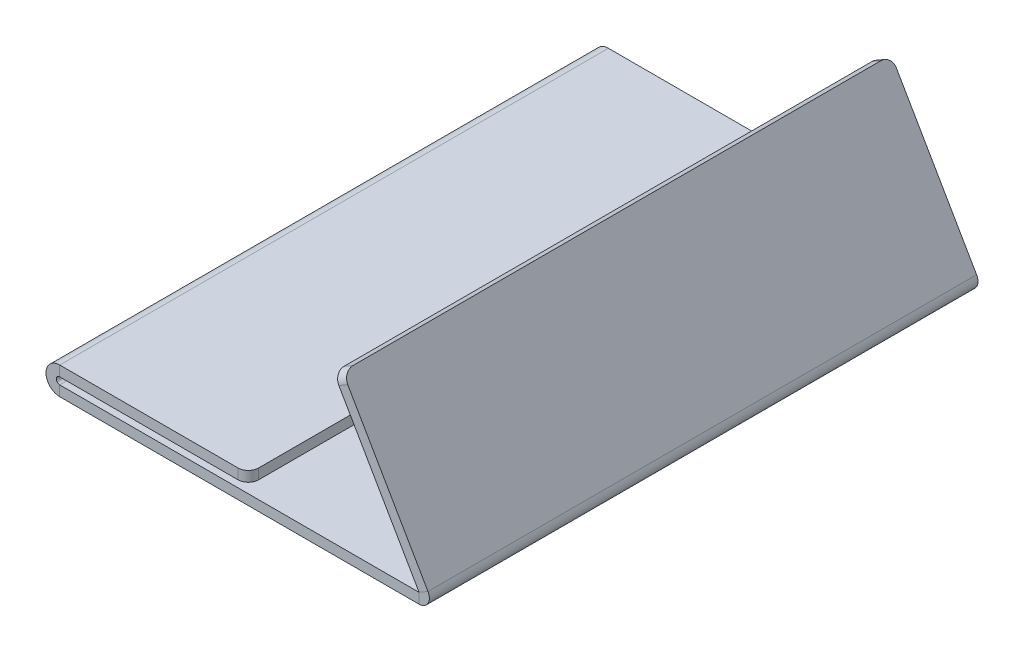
ISO-10303-21;
HEADER;
FILE_DESCRIPTION(('STEP AP214'),'2;1');
FILE_NAME('part.step','',(''),(''),'','','');
FILE_SCHEMA(('AUTOMOTIVE_DESIGN { 1 0 10303 214 1 1 1 1 }'));
ENDSEC;
DATA;
#1=APPLICATION_CONTEXT('core data for automotive mechanical design processes');
#2=APPLICATION_PROTOCOL_DEFINITION('international standard','automotive_design',2000,#1);
#3=PRODUCT_CONTEXT('',#1,'mechanical');
#4=PRODUCT('Part','Part','',(#3));
#5=PRODUCT_RELATED_PRODUCT_CATEGORY('part','',(#4));
#6=PRODUCT_DEFINITION_FORMATION('','',#4);
#7=PRODUCT_DEFINITION_CONTEXT('part definition',#1,'design');
#8=PRODUCT_DEFINITION('design','',#6,#7);
#9=PRODUCT_DEFINITION_SHAPE('','',#8);
#10=(LENGTH_UNIT() NAMED_UNIT(*) SI_UNIT(.MILLI.,.METRE.));
#11=(NAMED_UNIT(*) PLANE_ANGLE_UNIT() SI_UNIT($,.RADIAN.));
#12=(NAMED_UNIT(*) SI_UNIT($,.STERADIAN.) SOLID_ANGLE_UNIT());
#13=UNCERTAINTY_MEASURE_WITH_UNIT(LENGTH_MEASURE(1.E-05),#10,'distance_accuracy_value','');
#14=(GEOMETRIC_REPRESENTATION_CONTEXT(3) GLOBAL_UNCERTAINTY_ASSIGNED_CONTEXT((#13)) GLOBAL_UNIT_ASSIGNED_CONTEXT((#10,
#11,#12)) REPRESENTATION_CONTEXT('',''));
#15=CARTESIAN_POINT('',(0.,0.,0.));
#16=DIRECTION('',(0.,0.,1.));
#17=DIRECTION('',(1.,0.,0.));
#18=AXIS2_PLACEMENT_3D('',#15,#16,#17);
#19=CARTESIAN_POINT('',(0.,0.,-160.));
#20=DIRECTION('',(0.,-1.,0.));
#21=DIRECTION('',(0.,0.,-1.));
#22=AXIS2_PLACEMENT_3D('',#19,#20,#21);
#23=PLANE('',#22);
#24=DIRECTION('',(1.,0.,0.));
#25=VECTOR('',#24,1.);
#26=CARTESIAN_POINT('',(0.,0.,0.));
#27=LINE('',#26,#25);
#28=CARTESIAN_POINT('',(55.005,0.,0.));
#29=VERTEX_POINT('',#28);
#30=CARTESIAN_POINT('',(159.791527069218,0.,0.));
#31=VERTEX_POINT('',#30);
#32=EDGE_CURVE('E224',#29,#31,#27,.T.);
#33=ORIENTED_EDGE('',*,*,#32,.F.);
#34=DIRECTION('',(0.,0.,-1.));
#35=VECTOR('',#34,1.);
#36=CARTESIAN_POINT('',(55.005,0.,-160.));
#37=LINE('',#36,#35);
#38=CARTESIAN_POINT('',(55.005,0.,-160.));
#39=VERTEX_POINT('',#38);
#40=EDGE_CURVE('E263',#29,#39,#37,.T.);
#41=ORIENTED_EDGE('',*,*,#40,.T.);
#42=DIRECTION('',(-1.,0.,0.));
#43=VECTOR('',#42,1.);
#44=CARTESIAN_POINT('',(0.,0.,-160.));
#45=LINE('',#44,#43);
#46=CARTESIAN_POINT('',(159.791527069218,0.,-160.));
#47=VERTEX_POINT('',#46);
#48=EDGE_CURVE('E225',#47,#39,#45,.T.);
#49=ORIENTED_EDGE('',*,*,#48,.F.);
#50=DIRECTION('',(0.,0.,1.));
#51=VECTOR('',#50,1.);
#52=CARTESIAN_POINT('',(159.791527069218,0.,-160.));
#53=LINE('',#52,#51);
#54=EDGE_CURVE('E221',#47,#31,#53,.T.);
#55=ORIENTED_EDGE('',*,*,#54,.T.);
#56=EDGE_LOOP('',(#33,#41,#49,#55));
#57=FACE_BOUND('',#56,.T.);
#58=ADVANCED_FACE('F40',(#57),#23,.T.);
#59=CARTESIAN_POINT('',(244.904423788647,-144.389861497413,-160.));
#60=DIRECTION('',(0.866025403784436,0.500000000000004,0.));
#61=DIRECTION('',(0.,0.,-1.));
#62=AXIS2_PLACEMENT_3D('',#59,#60,#61);
#63=PLANE('',#62);
#64=DIRECTION('',(-0.500000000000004,0.866025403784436,0.));
#65=VECTOR('',#64,1.);
#66=CARTESIAN_POINT('',(244.904423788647,-144.389861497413,0.));
#67=LINE('',#66,#65);
#68=CARTESIAN_POINT('',(159.800187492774,3.01500009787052,0.));
#69=VERTEX_POINT('',#68);
#70=CARTESIAN_POINT('',(136.404423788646,43.5376511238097,0.));
#71=VERTEX_POINT('',#70);
#72=EDGE_CURVE('E243',#69,#71,#67,.T.);
#73=ORIENTED_EDGE('',*,*,#72,.T.);
#74=CARTESIAN_POINT('',(136.404423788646,43.5376511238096,-3.));
#75=DIRECTION('',(0.866025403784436,0.500000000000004,0.));
#76=DIRECTION('',(-0.500000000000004,0.866025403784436,0.));
#77=AXIS2_PLACEMENT_3D('',#74,#75,#76);
#78=CIRCLE('',#77,3.);
#79=CARTESIAN_POINT('',(134.904423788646,46.1357273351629,-3.));
#80=VERTEX_POINT('',#79);
#81=EDGE_CURVE('E48',#71,#80,#78,.F.);
#82=ORIENTED_EDGE('',*,*,#81,.T.);
#83=DIRECTION('',(0.,0.,-1.));
#84=VECTOR('',#83,1.);
#85=CARTESIAN_POINT('',(134.904423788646,46.1357273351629,0.));
#86=LINE('',#85,#84);
#87=CARTESIAN_POINT('',(134.904423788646,46.1357273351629,-157.));
#88=VERTEX_POINT('',#87);
#89=EDGE_CURVE('E240',#80,#88,#86,.T.);
#90=ORIENTED_EDGE('',*,*,#89,.T.);
#91=CARTESIAN_POINT('',(136.404423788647,43.5376511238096,-157.));
#92=DIRECTION('',(0.866025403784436,0.500000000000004,0.));
#93=DIRECTION('',(-0.500000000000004,0.866025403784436,0.));
#94=AXIS2_PLACEMENT_3D('',#91,#92,#93);
#95=CIRCLE('',#94,3.);
#96=CARTESIAN_POINT('',(136.404423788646,43.5376511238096,-160.));
#97=VERTEX_POINT('',#96);
#98=EDGE_CURVE('E55',#88,#97,#95,.F.);
#99=ORIENTED_EDGE('',*,*,#98,.T.);
#100=DIRECTION('',(0.500000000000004,-0.866025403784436,0.));
#101=VECTOR('',#100,1.);
#102=CARTESIAN_POINT('',(244.904423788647,-144.389861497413,-160.));
#103=LINE('',#102,#101);
#104=CARTESIAN_POINT('',(159.800187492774,3.01500009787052,-160.));
#105=VERTEX_POINT('',#104);
#106=EDGE_CURVE('E242',#97,#105,#103,.T.);
#107=ORIENTED_EDGE('',*,*,#106,.T.);
#108=DIRECTION('',(0.,0.,1.));
#109=VECTOR('',#108,1.);
#110=CARTESIAN_POINT('',(159.800187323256,3.01499999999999,-160.));
#111=LINE('',#110,#109);
#112=EDGE_CURVE('E244',#105,#69,#111,.T.);
#113=ORIENTED_EDGE('',*,*,#112,.T.);
#114=EDGE_LOOP('',(#73,#82,#90,#99,#107,#113));
#115=FACE_BOUND('',#114,.T.);
#116=ADVANCED_FACE('F303',(#115),#63,.F.);
#117=CARTESIAN_POINT('',(244.904423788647,-144.389861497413,-160.));
#118=DIRECTION('',(0.,0.,1.));
#119=DIRECTION('',(-0.500000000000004,0.866025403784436,0.));
#120=AXIS2_PLACEMENT_3D('',#117,#118,#119);
#121=PLANE('',#120);
#122=ORIENTED_EDGE('',*,*,#106,.F.);
#123=DIRECTION('',(0.866025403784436,0.500000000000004,0.));
#124=VECTOR('',#123,1.);
#125=CARTESIAN_POINT('',(136.404423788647,43.5376511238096,-160.));
#126=LINE('',#125,#124);
#127=CARTESIAN_POINT('',(139.0025,45.0376511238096,-160.));
#128=VERTEX_POINT('',#127);
#129=EDGE_CURVE('E12',#97,#128,#126,.T.);
#130=ORIENTED_EDGE('',*,*,#129,.T.);
#131=DIRECTION('',(0.500000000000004,-0.866025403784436,0.));
#132=VECTOR('',#131,1.);
#133=CARTESIAN_POINT('',(247.502500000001,-142.889861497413,-160.));
#134=LINE('',#133,#132);
#135=CARTESIAN_POINT('',(162.398263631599,4.51500005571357,-160.));
#136=VERTEX_POINT('',#135);
#137=EDGE_CURVE('E238',#128,#136,#134,.T.);
#138=ORIENTED_EDGE('',*,*,#137,.T.);
#139=DIRECTION('',(-0.866025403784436,-0.500000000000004,0.));
#140=VECTOR('',#139,1.);
#141=CARTESIAN_POINT('',(159.800187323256,3.01499999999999,-160.));
#142=LINE('',#141,#140);
#143=EDGE_CURVE('E247',#136,#105,#142,.T.);
#144=ORIENTED_EDGE('',*,*,#143,.T.);
#145=EDGE_LOOP('',(#122,#130,#138,#144));
#146=FACE_BOUND('',#145,.T.);
#147=ADVANCED_FACE('F384',(#146),#121,.F.);
#148=CARTESIAN_POINT('',(244.904423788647,-144.389861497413,0.));
#149=DIRECTION('',(0.,0.,-1.));
#150=DIRECTION('',(0.500000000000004,-0.866025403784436,0.));
#151=AXIS2_PLACEMENT_3D('',#148,#149,#150);
#152=PLANE('',#151);
#153=DIRECTION('',(-0.500000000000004,0.866025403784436,0.));
#154=VECTOR('',#153,1.);
#155=CARTESIAN_POINT('',(247.502500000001,-142.889861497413,0.));
#156=LINE('',#155,#154);
#157=CARTESIAN_POINT('',(162.398263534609,4.51499999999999,0.));
#158=VERTEX_POINT('',#157);
#159=CARTESIAN_POINT('',(139.0025,45.0376511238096,0.));
#160=VERTEX_POINT('',#159);
#161=EDGE_CURVE('E239',#158,#160,#156,.T.);
#162=ORIENTED_EDGE('',*,*,#161,.T.);
#163=DIRECTION('',(0.866025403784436,0.500000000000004,0.));
#164=VECTOR('',#163,1.);
#165=CARTESIAN_POINT('',(136.404423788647,43.5376511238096,0.));
#166=LINE('',#165,#164);
#167=EDGE_CURVE('E63',#160,#71,#166,.F.);
#168=ORIENTED_EDGE('',*,*,#167,.T.);
#169=ORIENTED_EDGE('',*,*,#72,.F.);
#170=DIRECTION('',(0.866025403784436,0.500000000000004,0.));
#171=VECTOR('',#170,1.);
#172=CARTESIAN_POINT('',(159.800187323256,3.01499999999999,0.));
#173=LINE('',#172,#171);
#174=EDGE_CURVE('E252',#69,#158,#173,.T.);
#175=ORIENTED_EDGE('',*,*,#174,.T.);
#176=EDGE_LOOP('',(#162,#168,#169,#175));
#177=FACE_BOUND('',#176,.T.);
#178=ADVANCED_FACE('F315',(#177),#152,.F.);
#179=CARTESIAN_POINT('',(134.904423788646,46.1357273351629,0.));
#180=DIRECTION('',(0.500000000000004,-0.866025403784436,0.));
#181=DIRECTION('',(0.,0.,1.));
#182=AXIS2_PLACEMENT_3D('',#179,#180,#181);
#183=PLANE('',#182);
#184=ORIENTED_EDGE('',*,*,#89,.F.);
#185=DIRECTION('',(0.866025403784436,0.500000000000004,0.));
#186=VECTOR('',#185,1.);
#187=CARTESIAN_POINT('',(134.904423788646,46.1357273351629,-3.));
#188=LINE('',#187,#186);
#189=CARTESIAN_POINT('',(137.5025,47.6357273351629,-3.));
#190=VERTEX_POINT('',#189);
#191=EDGE_CURVE('E293',#80,#190,#188,.T.);
#192=ORIENTED_EDGE('',*,*,#191,.T.);
#193=DIRECTION('',(0.,0.,-1.));
#194=VECTOR('',#193,1.);
#195=CARTESIAN_POINT('',(137.5025,47.6357273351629,0.));
#196=LINE('',#195,#194);
#197=CARTESIAN_POINT('',(137.5025,47.6357273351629,-157.));
#198=VERTEX_POINT('',#197);
#199=EDGE_CURVE('E235',#190,#198,#196,.T.);
#200=ORIENTED_EDGE('',*,*,#199,.T.);
#201=DIRECTION('',(0.866025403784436,0.500000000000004,0.));
#202=VECTOR('',#201,1.);
#203=CARTESIAN_POINT('',(134.904423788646,46.1357273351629,-157.));
#204=LINE('',#203,#202);
#205=EDGE_CURVE('E291',#198,#88,#204,.F.);
#206=ORIENTED_EDGE('',*,*,#205,.T.);
#207=EDGE_LOOP('',(#184,#192,#200,#206));
#208=FACE_BOUND('',#207,.T.);
#209=ADVANCED_FACE('F307',(#208),#183,.F.);
#210=CARTESIAN_POINT('',(247.502500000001,-142.889861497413,-160.));
#211=DIRECTION('',(0.866025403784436,0.500000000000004,0.));
#212=DIRECTION('',(0.,0.,-1.));
#213=AXIS2_PLACEMENT_3D('',#210,#211,#212);
#214=PLANE('',#213);
#215=ORIENTED_EDGE('',*,*,#199,.F.);
#216=CARTESIAN_POINT('',(139.0025,45.0376511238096,-3.));
#217=DIRECTION('',(0.866025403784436,0.500000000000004,0.));
#218=DIRECTION('',(-0.500000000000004,0.866025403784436,0.));
#219=AXIS2_PLACEMENT_3D('',#216,#217,#218);
#220=CIRCLE('',#219,3.);
#221=EDGE_CURVE('E298',#190,#160,#220,.T.);
#222=ORIENTED_EDGE('',*,*,#221,.T.);
#223=ORIENTED_EDGE('',*,*,#161,.F.);
#224=DIRECTION('',(0.,0.,1.));
#225=VECTOR('',#224,1.);
#226=CARTESIAN_POINT('',(162.398263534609,4.51499999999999,-160.));
#227=LINE('',#226,#225);
#228=EDGE_CURVE('E250',#136,#158,#227,.T.);
#229=ORIENTED_EDGE('',*,*,#228,.F.);
#230=ORIENTED_EDGE('',*,*,#137,.F.);
#231=CARTESIAN_POINT('',(139.0025,45.0376511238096,-157.));
#232=DIRECTION('',(0.866025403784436,0.500000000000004,0.));
#233=DIRECTION('',(-0.500000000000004,0.866025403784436,0.));
#234=AXIS2_PLACEMENT_3D('',#231,#232,#233);
#235=CIRCLE('',#234,3.);
#236=EDGE_CURVE('E296',#128,#198,#235,.T.);
#237=ORIENTED_EDGE('',*,*,#236,.T.);
#238=EDGE_LOOP('',(#215,#222,#223,#229,#230,#237));
#239=FACE_BOUND('',#238,.T.);
#240=ADVANCED_FACE('F313',(#239),#214,.T.);
#241=CARTESIAN_POINT('',(0.,3.,-160.));
#242=DIRECTION('',(0.,-1.,0.));
#243=DIRECTION('',(0.,0.,-1.));
#244=AXIS2_PLACEMENT_3D('',#241,#242,#243);
#245=PLANE('',#244);
#246=DIRECTION('',(0.,0.,-1.));
#247=VECTOR('',#246,1.);
#248=CARTESIAN_POINT('',(55.005,3.,-160.));
#249=LINE('',#248,#247);
#250=CARTESIAN_POINT('',(55.005,3.,0.));
#251=VERTEX_POINT('',#250);
#252=CARTESIAN_POINT('',(55.005,3.,-160.));
#253=VERTEX_POINT('',#252);
#254=EDGE_CURVE('E255',#251,#253,#249,.T.);
#255=ORIENTED_EDGE('',*,*,#254,.F.);
#256=DIRECTION('',(1.,0.,0.));
#257=VECTOR('',#256,1.);
#258=CARTESIAN_POINT('',(0.,3.,0.));
#259=LINE('',#258,#257);
#260=CARTESIAN_POINT('',(159.791527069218,3.,0.));
#261=VERTEX_POINT('',#260);
#262=EDGE_CURVE('E272',#251,#261,#259,.T.);
#263=ORIENTED_EDGE('',*,*,#262,.T.);
#264=DIRECTION('',(0.,0.,1.));
#265=VECTOR('',#264,1.);
#266=CARTESIAN_POINT('',(159.791527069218,3.,-160.));
#267=LINE('',#266,#265);
#268=CARTESIAN_POINT('',(159.791527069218,2.99999997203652,-160.));
#269=VERTEX_POINT('',#268);
#270=EDGE_CURVE('E220',#269,#261,#267,.T.);
#271=ORIENTED_EDGE('',*,*,#270,.F.);
#272=DIRECTION('',(-1.,0.,0.));
#273=VECTOR('',#272,1.);
#274=CARTESIAN_POINT('',(0.,3.,-160.));
#275=LINE('',#274,#273);
#276=EDGE_CURVE('E229',#269,#253,#275,.T.);
#277=ORIENTED_EDGE('',*,*,#276,.T.);
#278=EDGE_LOOP('',(#255,#263,#271,#277));
#279=FACE_BOUND('',#278,.T.);
#280=ADVANCED_FACE('F389',(#279),#245,.F.);
#281=CARTESIAN_POINT('',(0.,3.,-160.));
#282=DIRECTION('',(0.,0.,1.));
#283=DIRECTION('',(1.,0.,0.));
#284=AXIS2_PLACEMENT_3D('',#281,#282,#283);
#285=PLANE('',#284);
#286=DIRECTION('',(0.,-1.,0.));
#287=VECTOR('',#286,1.);
#288=CARTESIAN_POINT('',(55.005,3.,-160.));
#289=LINE('',#288,#287);
#290=EDGE_CURVE('E186',#253,#39,#289,.T.);
#291=ORIENTED_EDGE('',*,*,#290,.F.);
#292=ORIENTED_EDGE('',*,*,#276,.F.);
#293=DIRECTION('',(0.,1.,0.));
#294=VECTOR('',#293,1.);
#295=CARTESIAN_POINT('',(159.791527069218,3.,-160.));
#296=LINE('',#295,#294);
#297=EDGE_CURVE('E226',#47,#269,#296,.T.);
#298=ORIENTED_EDGE('',*,*,#297,.F.);
#299=ORIENTED_EDGE('',*,*,#48,.T.);
#300=EDGE_LOOP('',(#291,#292,#298,#299));
#301=FACE_BOUND('',#300,.T.);
#302=ADVANCED_FACE('F334',(#301),#285,.F.);
#303=CARTESIAN_POINT('',(0.,3.,0.));
#304=DIRECTION('',(0.,0.,-1.));
#305=DIRECTION('',(-1.,0.,0.));
#306=AXIS2_PLACEMENT_3D('',#303,#304,#305);
#307=PLANE('',#306);
#308=DIRECTION('',(0.,1.,0.));
#309=VECTOR('',#308,1.);
#310=CARTESIAN_POINT('',(55.005,3.,0.));
#311=LINE('',#310,#309);
#312=EDGE_CURVE('E266',#29,#251,#311,.T.);
#313=ORIENTED_EDGE('',*,*,#312,.F.);
#314=ORIENTED_EDGE('',*,*,#32,.T.);
#315=DIRECTION('',(0.,-1.,0.));
#316=VECTOR('',#315,1.);
#317=CARTESIAN_POINT('',(159.791527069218,3.,0.));
#318=LINE('',#317,#316);
#319=EDGE_CURVE('E230',#261,#31,#318,.T.);
#320=ORIENTED_EDGE('',*,*,#319,.F.);
#321=ORIENTED_EDGE('',*,*,#262,.F.);
#322=EDGE_LOOP('',(#313,#314,#320,#321));
#323=FACE_BOUND('',#322,.T.);
#324=ADVANCED_FACE('F42',(#323),#307,.F.);
#325=CARTESIAN_POINT('',(159.791527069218,3.01000011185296,-160.));
#326=DIRECTION('',(0.,0.,1.));
#327=DIRECTION('',(1.,0.,0.));
#328=AXIS2_PLACEMENT_3D('',#325,#326,#327);
#329=PLANE('',#328);
#330=ORIENTED_EDGE('',*,*,#143,.F.);
#331=CARTESIAN_POINT('',(159.791527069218,3.01,-160.));
#332=DIRECTION('',(0.,0.,-1.));
#333=DIRECTION('',(-1.,0.,0.));
#334=AXIS2_PLACEMENT_3D('',#331,#332,#333);
#335=CIRCLE('',#334,3.01000011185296);
#336=EDGE_CURVE('E208',#136,#47,#335,.T.);
#337=ORIENTED_EDGE('',*,*,#336,.T.);
#338=ORIENTED_EDGE('',*,*,#297,.T.);
#339=CARTESIAN_POINT('',(159.791527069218,3.01000011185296,-160.));
#340=DIRECTION('',(0.,0.,-1.));
#341=DIRECTION('',(-1.,0.,0.));
#342=AXIS2_PLACEMENT_3D('',#339,#340,#341);
#343=CIRCLE('',#342,0.0100001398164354);
#344=EDGE_CURVE('E212',#105,#269,#343,.T.);
#345=ORIENTED_EDGE('',*,*,#344,.F.);
#346=EDGE_LOOP('',(#330,#337,#338,#345));
#347=FACE_BOUND('',#346,.T.);
#348=ADVANCED_FACE('F329',(#347),#329,.F.);
#349=CARTESIAN_POINT('',(159.791527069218,3.01000011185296,0.));
#350=DIRECTION('',(0.,0.,-1.));
#351=DIRECTION('',(-1.,0.,0.));
#352=AXIS2_PLACEMENT_3D('',#349,#350,#351);
#353=PLANE('',#352);
#354=ORIENTED_EDGE('',*,*,#319,.T.);
#355=CARTESIAN_POINT('',(159.791527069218,3.01,0.));
#356=DIRECTION('',(0.,0.,-1.));
#357=DIRECTION('',(-1.,0.,0.));
#358=AXIS2_PLACEMENT_3D('',#355,#356,#357);
#359=CIRCLE('',#358,3.01000011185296);
#360=EDGE_CURVE('E209',#31,#158,#359,.F.);
#361=ORIENTED_EDGE('',*,*,#360,.T.);
#362=ORIENTED_EDGE('',*,*,#174,.F.);
#363=CARTESIAN_POINT('',(159.791527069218,3.01000011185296,0.));
#364=DIRECTION('',(0.,0.,1.));
#365=DIRECTION('',(1.,0.,0.));
#366=AXIS2_PLACEMENT_3D('',#363,#364,#365);
#367=CIRCLE('',#366,0.0100001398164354);
#368=EDGE_CURVE('E217',#261,#69,#367,.T.);
#369=ORIENTED_EDGE('',*,*,#368,.F.);
#370=EDGE_LOOP('',(#354,#361,#362,#369));
#371=FACE_BOUND('',#370,.T.);
#372=ADVANCED_FACE('F318',(#371),#353,.F.);
#373=CARTESIAN_POINT('',(159.791527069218,3.01,80.3668069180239));
#374=DIRECTION('',(0.,0.,-1.));
#375=DIRECTION('',(-1.,0.,0.));
#376=AXIS2_PLACEMENT_3D('',#373,#374,#375);
#377=CYLINDRICAL_SURFACE('',#376,0.0100001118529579);
#378=ORIENTED_EDGE('',*,*,#368,.T.);
#379=ORIENTED_EDGE('',*,*,#112,.F.);
#380=ORIENTED_EDGE('',*,*,#344,.T.);
#381=ORIENTED_EDGE('',*,*,#270,.T.);
#382=EDGE_LOOP('',(#378,#379,#380,#381));
#383=FACE_BOUND('',#382,.T.);
#384=ADVANCED_FACE('F322',(#383),#377,.F.);
#385=CARTESIAN_POINT('',(159.791527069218,3.01,80.3668069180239));
#386=DIRECTION('',(0.,0.,-1.));
#387=DIRECTION('',(-1.,0.,0.));
#388=AXIS2_PLACEMENT_3D('',#385,#386,#387);
#389=CYLINDRICAL_SURFACE('',#388,3.01000011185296);
#390=ORIENTED_EDGE('',*,*,#360,.F.);
#391=ORIENTED_EDGE('',*,*,#54,.F.);
#392=ORIENTED_EDGE('',*,*,#336,.F.);
#393=ORIENTED_EDGE('',*,*,#228,.T.);
#394=EDGE_LOOP('',(#390,#391,#392,#393));
#395=FACE_BOUND('',#394,.T.);
#396=ADVANCED_FACE('F336',(#395),#389,.T.);
#397=CARTESIAN_POINT('',(55.005,4.00999996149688,0.));
#398=DIRECTION('',(0.,0.,-1.));
#399=DIRECTION('',(-1.,0.,0.));
#400=AXIS2_PLACEMENT_3D('',#397,#398,#399);
#401=PLANE('',#400);
#402=DIRECTION('',(0.,-1.,0.));
#403=VECTOR('',#402,1.);
#404=CARTESIAN_POINT('',(55.005,5.02,0.));
#405=LINE('',#404,#403);
#406=CARTESIAN_POINT('',(55.0050000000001,8.02,0.));
#407=VERTEX_POINT('',#406);
#408=CARTESIAN_POINT('',(55.005,5.02,0.));
#409=VERTEX_POINT('',#408);
#410=EDGE_CURVE('E203',#407,#409,#405,.T.);
#411=ORIENTED_EDGE('',*,*,#410,.F.);
#412=CARTESIAN_POINT('',(55.005,4.01,0.));
#413=DIRECTION('',(0.,0.,1.));
#414=DIRECTION('',(1.,0.,0.));
#415=AXIS2_PLACEMENT_3D('',#412,#413,#414);
#416=CIRCLE('',#415,4.00999996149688);
#417=EDGE_CURVE('E190',#407,#29,#416,.T.);
#418=ORIENTED_EDGE('',*,*,#417,.T.);
#419=ORIENTED_EDGE('',*,*,#312,.T.);
#420=CARTESIAN_POINT('',(55.005,4.00999996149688,0.));
#421=DIRECTION('',(0.,0.,1.));
#422=DIRECTION('',(1.,0.,0.));
#423=AXIS2_PLACEMENT_3D('',#420,#421,#422);
#424=CIRCLE('',#423,1.00999996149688);
#425=EDGE_CURVE('E189',#409,#251,#424,.T.);
#426=ORIENTED_EDGE('',*,*,#425,.F.);
#427=EDGE_LOOP('',(#411,#418,#419,#426));
#428=FACE_BOUND('',#427,.T.);
#429=ADVANCED_FACE('F344',(#428),#401,.F.);
#430=CARTESIAN_POINT('',(55.005,4.00999996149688,-160.));
#431=DIRECTION('',(0.,0.,1.));
#432=DIRECTION('',(1.,0.,0.));
#433=AXIS2_PLACEMENT_3D('',#430,#431,#432);
#434=PLANE('',#433);
#435=ORIENTED_EDGE('',*,*,#290,.T.);
#436=CARTESIAN_POINT('',(55.005,4.01,-160.));
#437=DIRECTION('',(0.,0.,1.));
#438=DIRECTION('',(1.,0.,0.));
#439=AXIS2_PLACEMENT_3D('',#436,#437,#438);
#440=CIRCLE('',#439,4.00999996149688);
#441=CARTESIAN_POINT('',(55.0050000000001,8.02,-160.));
#442=VERTEX_POINT('',#441);
#443=EDGE_CURVE('E183',#39,#442,#440,.F.);
#444=ORIENTED_EDGE('',*,*,#443,.T.);
#445=DIRECTION('',(0.,1.,0.));
#446=VECTOR('',#445,1.);
#447=CARTESIAN_POINT('',(55.005,5.02,-160.));
#448=LINE('',#447,#446);
#449=CARTESIAN_POINT('',(55.0049999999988,5.01999992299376,-160.));
#450=VERTEX_POINT('',#449);
#451=EDGE_CURVE('E168',#450,#442,#448,.T.);
#452=ORIENTED_EDGE('',*,*,#451,.F.);
#453=CARTESIAN_POINT('',(55.005,4.00999996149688,-160.));
#454=DIRECTION('',(0.,0.,-1.));
#455=DIRECTION('',(-1.,0.,0.));
#456=AXIS2_PLACEMENT_3D('',#453,#454,#455);
#457=CIRCLE('',#456,1.00999996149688);
#458=EDGE_CURVE('E206',#253,#450,#457,.T.);
#459=ORIENTED_EDGE('',*,*,#458,.F.);
#460=EDGE_LOOP('',(#435,#444,#452,#459));
#461=FACE_BOUND('',#460,.T.);
#462=ADVANCED_FACE('F184',(#461),#434,.F.);
#463=CARTESIAN_POINT('',(55.005,4.01,-240.028122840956));
#464=DIRECTION('',(0.,0.,1.));
#465=DIRECTION('',(1.,0.,0.));
#466=AXIS2_PLACEMENT_3D('',#463,#464,#465);
#467=CYLINDRICAL_SURFACE('',#466,1.00999996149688);
#468=ORIENTED_EDGE('',*,*,#458,.T.);
#469=DIRECTION('',(0.,0.,-1.));
#470=VECTOR('',#469,1.);
#471=CARTESIAN_POINT('',(55.005,5.02,-160.));
#472=LINE('',#471,#470);
#473=EDGE_CURVE('E355',#409,#450,#472,.T.);
#474=ORIENTED_EDGE('',*,*,#473,.F.);
#475=ORIENTED_EDGE('',*,*,#425,.T.);
#476=ORIENTED_EDGE('',*,*,#254,.T.);
#477=EDGE_LOOP('',(#468,#474,#475,#476));
#478=FACE_BOUND('',#477,.T.);
#479=ADVANCED_FACE('F413',(#478),#467,.F.);
#480=CARTESIAN_POINT('',(55.005,4.01,-240.028122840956));
#481=DIRECTION('',(0.,0.,1.));
#482=DIRECTION('',(1.,0.,0.));
#483=AXIS2_PLACEMENT_3D('',#480,#481,#482);
#484=CYLINDRICAL_SURFACE('',#483,4.00999996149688);
#485=ORIENTED_EDGE('',*,*,#443,.F.);
#486=ORIENTED_EDGE('',*,*,#40,.F.);
#487=ORIENTED_EDGE('',*,*,#417,.F.);
#488=DIRECTION('',(0.,0.,-1.));
#489=VECTOR('',#488,1.);
#490=CARTESIAN_POINT('',(55.0050000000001,8.02,-160.));
#491=LINE('',#490,#489);
#492=EDGE_CURVE('E162',#407,#442,#491,.T.);
#493=ORIENTED_EDGE('',*,*,#492,.T.);
#494=EDGE_LOOP('',(#485,#486,#487,#493));
#495=FACE_BOUND('',#494,.T.);
#496=ADVANCED_FACE('F193',(#495),#484,.T.);
#497=CARTESIAN_POINT('',(110.,5.01999999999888,0.));
#498=DIRECTION('',(-1.,0.,0.));
#499=DIRECTION('',(0.,0.,-1.));
#500=AXIS2_PLACEMENT_3D('',#497,#498,#499);
#501=PLANE('',#500);
#502=DIRECTION('',(0.,0.,1.));
#503=VECTOR('',#502,1.);
#504=CARTESIAN_POINT('',(110.,5.01999999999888,0.));
#505=LINE('',#504,#503);
#506=CARTESIAN_POINT('',(110.,5.01999999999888,-157.));
#507=VERTEX_POINT('',#506);
#508=CARTESIAN_POINT('',(110.,5.01999999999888,-3.));
#509=VERTEX_POINT('',#508);
#510=EDGE_CURVE('E179',#507,#509,#505,.T.);
#511=ORIENTED_EDGE('',*,*,#510,.F.);
#512=DIRECTION('',(0.,1.,0.));
#513=VECTOR('',#512,1.);
#514=CARTESIAN_POINT('',(110.,5.01999999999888,-157.));
#515=LINE('',#514,#513);
#516=CARTESIAN_POINT('',(110.,8.01999999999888,-157.));
#517=VERTEX_POINT('',#516);
#518=EDGE_CURVE('E276',#507,#517,#515,.T.);
#519=ORIENTED_EDGE('',*,*,#518,.T.);
#520=DIRECTION('',(0.,0.,1.));
#521=VECTOR('',#520,1.);
#522=CARTESIAN_POINT('',(110.,8.01999999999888,0.));
#523=LINE('',#522,#521);
#524=CARTESIAN_POINT('',(110.,8.01999999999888,-3.));
#525=VERTEX_POINT('',#524);
#526=EDGE_CURVE('E195',#517,#525,#523,.T.);
#527=ORIENTED_EDGE('',*,*,#526,.T.);
#528=DIRECTION('',(0.,1.,0.));
#529=VECTOR('',#528,1.);
#530=CARTESIAN_POINT('',(110.,5.01999999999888,-3.));
#531=LINE('',#530,#529);
#532=EDGE_CURVE('E269',#525,#509,#531,.F.);
#533=ORIENTED_EDGE('',*,*,#532,.T.);
#534=EDGE_LOOP('',(#511,#519,#527,#533));
#535=FACE_BOUND('',#534,.T.);
#536=ADVANCED_FACE('F366',(#535),#501,.F.);
#537=CARTESIAN_POINT('',(110.,5.01999999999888,-160.));
#538=DIRECTION('',(0.,1.,0.));
#539=DIRECTION('',(0.,0.,-1.));
#540=AXIS2_PLACEMENT_3D('',#537,#538,#539);
#541=PLANE('',#540);
#542=DIRECTION('',(1.,0.,0.));
#543=VECTOR('',#542,1.);
#544=CARTESIAN_POINT('',(110.,5.01999999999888,-160.));
#545=LINE('',#544,#543);
#546=CARTESIAN_POINT('',(107.,5.01999999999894,-160.));
#547=VERTEX_POINT('',#546);
#548=EDGE_CURVE('E174',#450,#547,#545,.T.);
#549=ORIENTED_EDGE('',*,*,#548,.T.);
#550=CARTESIAN_POINT('',(107.,5.01999999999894,-157.));
#551=DIRECTION('',(0.,1.,0.));
#552=DIRECTION('',(-1.,0.,0.));
#553=AXIS2_PLACEMENT_3D('',#550,#551,#552);
#554=CIRCLE('',#553,3.);
#555=EDGE_CURVE('E286',#547,#507,#554,.F.);
#556=ORIENTED_EDGE('',*,*,#555,.T.);
#557=ORIENTED_EDGE('',*,*,#510,.T.);
#558=CARTESIAN_POINT('',(107.,5.01999999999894,-3.));
#559=DIRECTION('',(0.,1.,0.));
#560=DIRECTION('',(-1.,0.,0.));
#561=AXIS2_PLACEMENT_3D('',#558,#559,#560);
#562=CIRCLE('',#561,3.);
#563=CARTESIAN_POINT('',(107.,5.01999999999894,0.));
#564=VERTEX_POINT('',#563);
#565=EDGE_CURVE('E284',#509,#564,#562,.F.);
#566=ORIENTED_EDGE('',*,*,#565,.T.);
#567=DIRECTION('',(-1.,0.,0.));
#568=VECTOR('',#567,1.);
#569=CARTESIAN_POINT('',(110.,5.01999999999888,0.));
#570=LINE('',#569,#568);
#571=EDGE_CURVE('E198',#564,#409,#570,.T.);
#572=ORIENTED_EDGE('',*,*,#571,.T.);
#573=ORIENTED_EDGE('',*,*,#473,.T.);
#574=EDGE_LOOP('',(#549,#556,#557,#566,#572,#573));
#575=FACE_BOUND('',#574,.T.);
#576=ADVANCED_FACE('F357',(#575),#541,.F.);
#577=CARTESIAN_POINT('',(110.,5.01999999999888,-160.));
#578=DIRECTION('',(0.,0.,1.));
#579=DIRECTION('',(-1.,0.,0.));
#580=AXIS2_PLACEMENT_3D('',#577,#578,#579);
#581=PLANE('',#580);
#582=DIRECTION('',(1.,0.,0.));
#583=VECTOR('',#582,1.);
#584=CARTESIAN_POINT('',(110.,8.01999999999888,-160.));
#585=LINE('',#584,#583);
#586=CARTESIAN_POINT('',(107.,8.01999999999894,-160.));
#587=VERTEX_POINT('',#586);
#588=EDGE_CURVE('E156',#442,#587,#585,.T.);
#589=ORIENTED_EDGE('',*,*,#588,.T.);
#590=DIRECTION('',(0.,1.,0.));
#591=VECTOR('',#590,1.);
#592=CARTESIAN_POINT('',(107.,5.01999999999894,-160.));
#593=LINE('',#592,#591);
#594=EDGE_CURVE('E282',#587,#547,#593,.F.);
#595=ORIENTED_EDGE('',*,*,#594,.T.);
#596=ORIENTED_EDGE('',*,*,#548,.F.);
#597=ORIENTED_EDGE('',*,*,#451,.T.);
#598=EDGE_LOOP('',(#589,#595,#596,#597));
#599=FACE_BOUND('',#598,.T.);
#600=ADVANCED_FACE('F172',(#599),#581,.F.);
#601=CARTESIAN_POINT('',(110.,8.01999999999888,-160.));
#602=DIRECTION('',(0.,1.,0.));
#603=DIRECTION('',(0.,0.,-1.));
#604=AXIS2_PLACEMENT_3D('',#601,#602,#603);
#605=PLANE('',#604);
#606=ORIENTED_EDGE('',*,*,#526,.F.);
#607=CARTESIAN_POINT('',(107.,8.01999999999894,-157.));
#608=DIRECTION('',(0.,1.,0.));
#609=DIRECTION('',(-1.,0.,0.));
#610=AXIS2_PLACEMENT_3D('',#607,#608,#609);
#611=CIRCLE('',#610,3.);
#612=EDGE_CURVE('E164',#517,#587,#611,.T.);
#613=ORIENTED_EDGE('',*,*,#612,.T.);
#614=ORIENTED_EDGE('',*,*,#588,.F.);
#615=ORIENTED_EDGE('',*,*,#492,.F.);
#616=DIRECTION('',(-1.,0.,0.));
#617=VECTOR('',#616,1.);
#618=CARTESIAN_POINT('',(110.,8.01999999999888,0.));
#619=LINE('',#618,#617);
#620=CARTESIAN_POINT('',(107.,8.01999999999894,0.));
#621=VERTEX_POINT('',#620);
#622=EDGE_CURVE('E167',#621,#407,#619,.T.);
#623=ORIENTED_EDGE('',*,*,#622,.F.);
#624=CARTESIAN_POINT('',(107.,8.01999999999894,-3.));
#625=DIRECTION('',(0.,1.,0.));
#626=DIRECTION('',(-1.,0.,0.));
#627=AXIS2_PLACEMENT_3D('',#624,#625,#626);
#628=CIRCLE('',#627,3.);
#629=EDGE_CURVE('E279',#621,#525,#628,.T.);
#630=ORIENTED_EDGE('',*,*,#629,.T.);
#631=EDGE_LOOP('',(#606,#613,#614,#615,#623,#630));
#632=FACE_BOUND('',#631,.T.);
#633=ADVANCED_FACE('F159',(#632),#605,.T.);
#634=CARTESIAN_POINT('',(110.,5.01999999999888,0.));
#635=DIRECTION('',(0.,0.,-1.));
#636=DIRECTION('',(1.,0.,0.));
#637=AXIS2_PLACEMENT_3D('',#634,#635,#636);
#638=PLANE('',#637);
#639=ORIENTED_EDGE('',*,*,#571,.F.);
#640=DIRECTION('',(0.,1.,0.));
#641=VECTOR('',#640,1.);
#642=CARTESIAN_POINT('',(107.,5.01999999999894,0.));
#643=LINE('',#642,#641);
#644=EDGE_CURVE('E288',#564,#621,#643,.T.);
#645=ORIENTED_EDGE('',*,*,#644,.T.);
#646=ORIENTED_EDGE('',*,*,#622,.T.);
#647=ORIENTED_EDGE('',*,*,#410,.T.);
#648=EDGE_LOOP('',(#639,#645,#646,#647));
#649=FACE_BOUND('',#648,.T.);
#650=ADVANCED_FACE('F360',(#649),#638,.F.);
#651=CARTESIAN_POINT('',(107.,5.01999999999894,-157.));
#652=DIRECTION('',(0.,1.,0.));
#653=DIRECTION('',(-1.,0.,0.));
#654=AXIS2_PLACEMENT_3D('',#651,#652,#653);
#655=CYLINDRICAL_SURFACE('',#654,3.);
#656=ORIENTED_EDGE('',*,*,#555,.F.);
#657=ORIENTED_EDGE('',*,*,#594,.F.);
#658=ORIENTED_EDGE('',*,*,#612,.F.);
#659=ORIENTED_EDGE('',*,*,#518,.F.);
#660=EDGE_LOOP('',(#656,#657,#658,#659));
#661=FACE_BOUND('',#660,.T.);
#662=ADVANCED_FACE('F370',(#661),#655,.T.);
#663=CARTESIAN_POINT('',(107.,5.01999999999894,-3.));
#664=DIRECTION('',(0.,1.,0.));
#665=DIRECTION('',(-1.,0.,0.));
#666=AXIS2_PLACEMENT_3D('',#663,#664,#665);
#667=CYLINDRICAL_SURFACE('',#666,3.);
#668=ORIENTED_EDGE('',*,*,#565,.F.);
#669=ORIENTED_EDGE('',*,*,#532,.F.);
#670=ORIENTED_EDGE('',*,*,#629,.F.);
#671=ORIENTED_EDGE('',*,*,#644,.F.);
#672=EDGE_LOOP('',(#668,#669,#670,#671));
#673=FACE_BOUND('',#672,.T.);
#674=ADVANCED_FACE('F362',(#673),#667,.T.);
#675=CARTESIAN_POINT('',(136.404423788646,43.5376511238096,-3.));
#676=DIRECTION('',(0.866025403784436,0.500000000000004,0.));
#677=DIRECTION('',(-0.500000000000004,0.866025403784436,0.));
#678=AXIS2_PLACEMENT_3D('',#675,#676,#677);
#679=CYLINDRICAL_SURFACE('',#678,3.);
#680=ORIENTED_EDGE('',*,*,#81,.F.);
#681=ORIENTED_EDGE('',*,*,#167,.F.);
#682=ORIENTED_EDGE('',*,*,#221,.F.);
#683=ORIENTED_EDGE('',*,*,#191,.F.);
#684=EDGE_LOOP('',(#680,#681,#682,#683));
#685=FACE_BOUND('',#684,.T.);
#686=ADVANCED_FACE('F310',(#685),#679,.T.);
#687=CARTESIAN_POINT('',(136.404423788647,43.5376511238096,-157.));
#688=DIRECTION('',(0.866025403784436,0.500000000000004,0.));
#689=DIRECTION('',(-0.500000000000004,0.866025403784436,0.));
#690=AXIS2_PLACEMENT_3D('',#687,#688,#689);
#691=CYLINDRICAL_SURFACE('',#690,3.);
#692=ORIENTED_EDGE('',*,*,#98,.F.);
#693=ORIENTED_EDGE('',*,*,#205,.F.);
#694=ORIENTED_EDGE('',*,*,#236,.F.);
#695=ORIENTED_EDGE('',*,*,#129,.F.);
#696=EDGE_LOOP('',(#692,#693,#694,#695));
#697=FACE_BOUND('',#696,.T.);
#698=ADVANCED_FACE('F466',(#697),#691,.T.);
#699=CLOSED_SHELL('',(#58,#116,#147,#178,#209,#240,#280,#302,#324,#348,#372,#384,#396,#429,#462,
#479,#496,#536,#576,#600,#633,#650,#662,#674,#686,#698));
#700=MANIFOLD_SOLID_BREP('B2',#699);
#701=ADVANCED_BREP_SHAPE_REPRESENTATION('',(#18,#700),#14);
#702=SHAPE_DEFINITION_REPRESENTATION(#9,#701);
ENDSEC;
END-ISO-10303-21;
